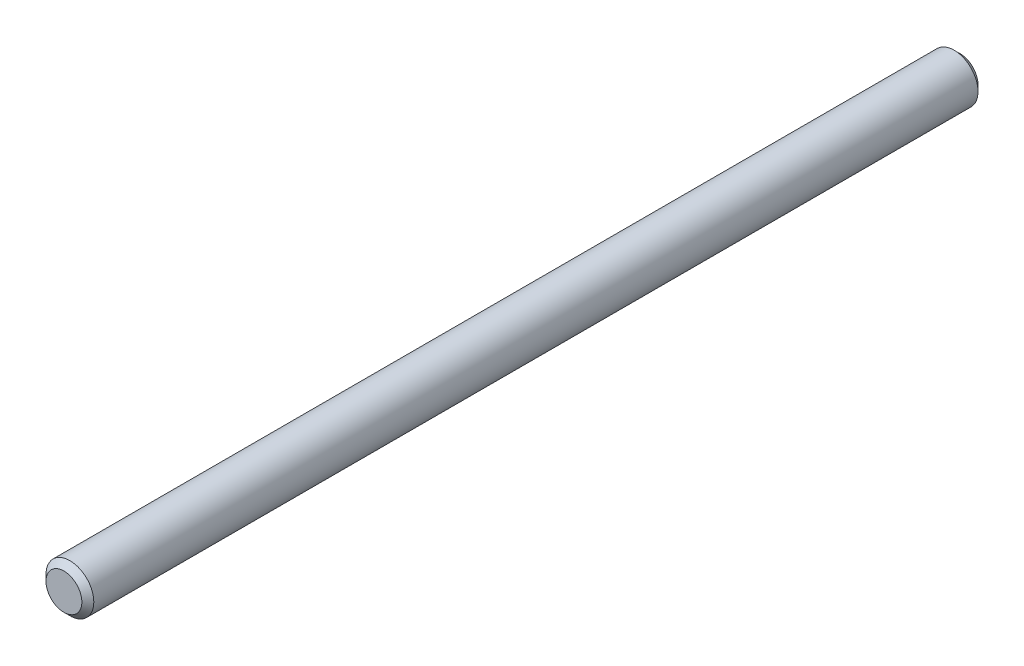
from build123d import *

# Parameters (mm, degrees)
SCHIZZO1_R                   = 4
ESTRUSIONE_ESTRUSIONE1_DEPTH = 150
SMUSSO1_SIZE                 = 1


with BuildPart() as part:
    # Schizzo1 → Estrusione-Estrusione1 (new body)
    with BuildSketch(Plane.XY):
        Circle(SCHIZZO1_R)
    extrude(amount=ESTRUSIONE_ESTRUSIONE1_DEPTH)

    # Smusso1
    smusso1_edges = [part.edges().sort_by_distance(p)[0] for p in [
        (-4, 0, 0),
        (-4, 0, 150),
    ]]
    chamfer(smusso1_edges, length=SMUSSO1_SIZE)


solid = part.part
